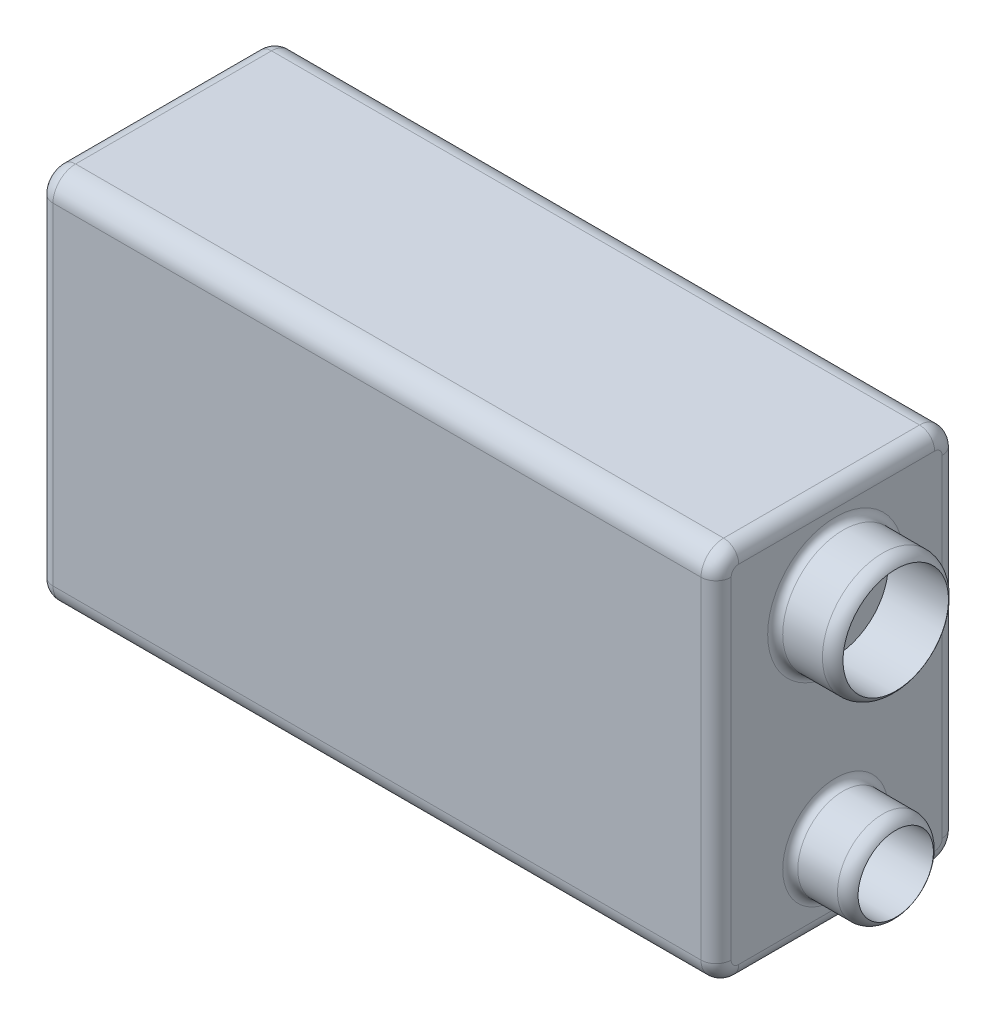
ISO-10303-21;
HEADER;
FILE_DESCRIPTION(('STEP AP214'),'2;1');
FILE_NAME('part.step','',(''),(''),'','','');
FILE_SCHEMA(('AUTOMOTIVE_DESIGN { 1 0 10303 214 1 1 1 1 }'));
ENDSEC;
DATA;
#1=APPLICATION_CONTEXT('core data for automotive mechanical design processes');
#2=APPLICATION_PROTOCOL_DEFINITION('international standard','automotive_design',2000,#1);
#3=PRODUCT_CONTEXT('',#1,'mechanical');
#4=PRODUCT('Part','Part','',(#3));
#5=PRODUCT_RELATED_PRODUCT_CATEGORY('part','',(#4));
#6=PRODUCT_DEFINITION_FORMATION('','',#4);
#7=PRODUCT_DEFINITION_CONTEXT('part definition',#1,'design');
#8=PRODUCT_DEFINITION('design','',#6,#7);
#9=PRODUCT_DEFINITION_SHAPE('','',#8);
#10=(LENGTH_UNIT() NAMED_UNIT(*) SI_UNIT(.MILLI.,.METRE.));
#11=(NAMED_UNIT(*) PLANE_ANGLE_UNIT() SI_UNIT($,.RADIAN.));
#12=(NAMED_UNIT(*) SI_UNIT($,.STERADIAN.) SOLID_ANGLE_UNIT());
#13=UNCERTAINTY_MEASURE_WITH_UNIT(LENGTH_MEASURE(1.E-05),#10,'distance_accuracy_value','');
#14=(GEOMETRIC_REPRESENTATION_CONTEXT(3) GLOBAL_UNCERTAINTY_ASSIGNED_CONTEXT((#13)) GLOBAL_UNIT_ASSIGNED_CONTEXT((#10,
#11,#12)) REPRESENTATION_CONTEXT('',''));
#15=CARTESIAN_POINT('',(0.,0.,0.));
#16=DIRECTION('',(0.,0.,1.));
#17=DIRECTION('',(1.,0.,0.));
#18=AXIS2_PLACEMENT_3D('',#15,#16,#17);
#19=CARTESIAN_POINT('',(45.,0.,16.));
#20=DIRECTION('',(-1.,0.,0.));
#21=DIRECTION('',(0.,0.,1.));
#22=AXIS2_PLACEMENT_3D('',#19,#20,#21);
#23=PLANE('',#22);
#24=CARTESIAN_POINT('',(45.,5.,8.07795165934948));
#25=DIRECTION('',(-1.,0.,0.));
#26=DIRECTION('',(0.,0.,1.));
#27=AXIS2_PLACEMENT_3D('',#24,#25,#26);
#28=CIRCLE('',#27,3.5);
#29=CARTESIAN_POINT('',(45.,5.,11.5779516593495));
#30=VERTEX_POINT('',#29);
#31=EDGE_CURVE('E285',#30,#30,#28,.T.);
#32=ORIENTED_EDGE('',*,*,#31,.T.);
#33=EDGE_LOOP('',(#32));
#34=FACE_BOUND('',#33,.T.);
#35=CARTESIAN_POINT('',(45.,19.,8.07795165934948));
#36=DIRECTION('',(-1.,0.,0.));
#37=DIRECTION('',(0.,0.,1.));
#38=AXIS2_PLACEMENT_3D('',#35,#36,#37);
#39=CIRCLE('',#38,4.5);
#40=CARTESIAN_POINT('',(45.,19.,12.5779516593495));
#41=VERTEX_POINT('',#40);
#42=EDGE_CURVE('E279',#41,#41,#39,.T.);
#43=ORIENTED_EDGE('',*,*,#42,.T.);
#44=EDGE_LOOP('',(#43));
#45=FACE_BOUND('',#44,.T.);
#46=DIRECTION('',(0.,1.,0.));
#47=VECTOR('',#46,1.);
#48=CARTESIAN_POINT('',(45.,0.,15.));
#49=LINE('',#48,#47);
#50=CARTESIAN_POINT('',(45.,23.5,15.));
#51=VERTEX_POINT('',#50);
#52=CARTESIAN_POINT('',(45.,1.5,15.));
#53=VERTEX_POINT('',#52);
#54=EDGE_CURVE('E235',#51,#53,#49,.F.);
#55=ORIENTED_EDGE('',*,*,#54,.T.);
#56=CARTESIAN_POINT('',(45.,1.5,14.5));
#57=DIRECTION('',(-1.,0.,0.));
#58=DIRECTION('',(0.,0.,1.));
#59=AXIS2_PLACEMENT_3D('',#56,#57,#58);
#60=CIRCLE('',#59,0.5);
#61=CARTESIAN_POINT('',(45.,1.,14.5));
#62=VERTEX_POINT('',#61);
#63=EDGE_CURVE('E237',#53,#62,#60,.F.);
#64=ORIENTED_EDGE('',*,*,#63,.T.);
#65=DIRECTION('',(0.,0.,-1.));
#66=VECTOR('',#65,1.);
#67=CARTESIAN_POINT('',(45.,1.,16.));
#68=LINE('',#67,#66);
#69=CARTESIAN_POINT('',(45.,1.,1.5));
#70=VERTEX_POINT('',#69);
#71=EDGE_CURVE('E204',#62,#70,#68,.T.);
#72=ORIENTED_EDGE('',*,*,#71,.T.);
#73=CARTESIAN_POINT('',(45.,1.5,1.5));
#74=DIRECTION('',(-1.,0.,0.));
#75=DIRECTION('',(0.,0.,1.));
#76=AXIS2_PLACEMENT_3D('',#73,#74,#75);
#77=CIRCLE('',#76,0.5);
#78=CARTESIAN_POINT('',(45.,1.5,1.));
#79=VERTEX_POINT('',#78);
#80=EDGE_CURVE('E225',#70,#79,#77,.F.);
#81=ORIENTED_EDGE('',*,*,#80,.T.);
#82=DIRECTION('',(0.,1.,0.));
#83=VECTOR('',#82,1.);
#84=CARTESIAN_POINT('',(45.,23.5,1.));
#85=LINE('',#84,#83);
#86=CARTESIAN_POINT('',(45.,23.5,1.));
#87=VERTEX_POINT('',#86);
#88=EDGE_CURVE('E227',#79,#87,#85,.T.);
#89=ORIENTED_EDGE('',*,*,#88,.T.);
#90=CARTESIAN_POINT('',(45.,23.5,1.5));
#91=DIRECTION('',(-1.,0.,0.));
#92=DIRECTION('',(0.,0.,1.));
#93=AXIS2_PLACEMENT_3D('',#90,#91,#92);
#94=CIRCLE('',#93,0.5);
#95=CARTESIAN_POINT('',(45.,24.,1.5));
#96=VERTEX_POINT('',#95);
#97=EDGE_CURVE('E229',#87,#96,#94,.F.);
#98=ORIENTED_EDGE('',*,*,#97,.T.);
#99=DIRECTION('',(0.,0.,-1.));
#100=VECTOR('',#99,1.);
#101=CARTESIAN_POINT('',(45.,24.,16.));
#102=LINE('',#101,#100);
#103=CARTESIAN_POINT('',(45.,24.,14.5));
#104=VERTEX_POINT('',#103);
#105=EDGE_CURVE('E231',#96,#104,#102,.F.);
#106=ORIENTED_EDGE('',*,*,#105,.T.);
#107=CARTESIAN_POINT('',(45.,23.5,14.5));
#108=DIRECTION('',(-1.,0.,0.));
#109=DIRECTION('',(0.,0.,1.));
#110=AXIS2_PLACEMENT_3D('',#107,#108,#109);
#111=CIRCLE('',#110,0.5);
#112=EDGE_CURVE('E233',#104,#51,#111,.F.);
#113=ORIENTED_EDGE('',*,*,#112,.T.);
#114=EDGE_LOOP('',(#55,#64,#72,#81,#89,#98,#106,#113));
#115=FACE_BOUND('',#114,.T.);
#116=ADVANCED_FACE('F39',(#34,#45,#115),#23,.F.);
#117=CARTESIAN_POINT('',(0.,0.,16.));
#118=DIRECTION('',(1.,0.,0.));
#119=DIRECTION('',(0.,0.,-1.));
#120=AXIS2_PLACEMENT_3D('',#117,#118,#119);
#121=PLANE('',#120);
#122=DIRECTION('',(0.,0.,-1.));
#123=VECTOR('',#122,1.);
#124=CARTESIAN_POINT('',(0.,24.,16.));
#125=LINE('',#124,#123);
#126=CARTESIAN_POINT('',(0.,24.,14.5));
#127=VERTEX_POINT('',#126);
#128=CARTESIAN_POINT('',(0.,24.,1.5));
#129=VERTEX_POINT('',#128);
#130=EDGE_CURVE('E180',#127,#129,#125,.T.);
#131=ORIENTED_EDGE('',*,*,#130,.T.);
#132=CARTESIAN_POINT('',(0.,23.5,1.5));
#133=DIRECTION('',(1.,0.,0.));
#134=DIRECTION('',(0.,0.,-1.));
#135=AXIS2_PLACEMENT_3D('',#132,#133,#134);
#136=CIRCLE('',#135,0.5);
#137=CARTESIAN_POINT('',(0.,23.5,1.));
#138=VERTEX_POINT('',#137);
#139=EDGE_CURVE('E160',#129,#138,#136,.F.);
#140=ORIENTED_EDGE('',*,*,#139,.T.);
#141=DIRECTION('',(0.,-1.,0.));
#142=VECTOR('',#141,1.);
#143=CARTESIAN_POINT('',(0.,1.5,1.));
#144=LINE('',#143,#142);
#145=CARTESIAN_POINT('',(0.,1.5,1.));
#146=VERTEX_POINT('',#145);
#147=EDGE_CURVE('E169',#138,#146,#144,.T.);
#148=ORIENTED_EDGE('',*,*,#147,.T.);
#149=CARTESIAN_POINT('',(0.,1.5,1.5));
#150=DIRECTION('',(1.,0.,0.));
#151=DIRECTION('',(0.,0.,-1.));
#152=AXIS2_PLACEMENT_3D('',#149,#150,#151);
#153=CIRCLE('',#152,0.5);
#154=CARTESIAN_POINT('',(0.,1.,1.5));
#155=VERTEX_POINT('',#154);
#156=EDGE_CURVE('E175',#146,#155,#153,.F.);
#157=ORIENTED_EDGE('',*,*,#156,.T.);
#158=DIRECTION('',(0.,0.,-1.));
#159=VECTOR('',#158,1.);
#160=CARTESIAN_POINT('',(0.,1.,16.));
#161=LINE('',#160,#159);
#162=CARTESIAN_POINT('',(0.,1.,14.5));
#163=VERTEX_POINT('',#162);
#164=EDGE_CURVE('E327',#155,#163,#161,.F.);
#165=ORIENTED_EDGE('',*,*,#164,.T.);
#166=CARTESIAN_POINT('',(0.,1.5,14.5));
#167=DIRECTION('',(1.,0.,0.));
#168=DIRECTION('',(0.,0.,-1.));
#169=AXIS2_PLACEMENT_3D('',#166,#167,#168);
#170=CIRCLE('',#169,0.5);
#171=CARTESIAN_POINT('',(0.,1.5,15.));
#172=VERTEX_POINT('',#171);
#173=EDGE_CURVE('E329',#163,#172,#170,.F.);
#174=ORIENTED_EDGE('',*,*,#173,.T.);
#175=DIRECTION('',(0.,-1.,0.));
#176=VECTOR('',#175,1.);
#177=CARTESIAN_POINT('',(0.,0.,15.));
#178=LINE('',#177,#176);
#179=CARTESIAN_POINT('',(0.,23.5,15.));
#180=VERTEX_POINT('',#179);
#181=EDGE_CURVE('E331',#172,#180,#178,.F.);
#182=ORIENTED_EDGE('',*,*,#181,.T.);
#183=CARTESIAN_POINT('',(0.,23.5,14.5));
#184=DIRECTION('',(1.,0.,0.));
#185=DIRECTION('',(0.,0.,-1.));
#186=AXIS2_PLACEMENT_3D('',#183,#184,#185);
#187=CIRCLE('',#186,0.5);
#188=EDGE_CURVE('E185',#180,#127,#187,.F.);
#189=ORIENTED_EDGE('',*,*,#188,.T.);
#190=EDGE_LOOP('',(#131,#140,#148,#157,#165,#174,#182,#189));
#191=FACE_BOUND('',#190,.T.);
#192=ADVANCED_FACE('F178',(#191),#121,.F.);
#193=CARTESIAN_POINT('',(0.,0.,16.));
#194=DIRECTION('',(0.,1.,0.));
#195=DIRECTION('',(0.,0.,1.));
#196=AXIS2_PLACEMENT_3D('',#193,#194,#195);
#197=PLANE('',#196);
#198=DIRECTION('',(1.,0.,0.));
#199=VECTOR('',#198,1.);
#200=CARTESIAN_POINT('',(45.,0.,1.5));
#201=LINE('',#200,#199);
#202=CARTESIAN_POINT('',(1.,0.,1.5));
#203=VERTEX_POINT('',#202);
#204=CARTESIAN_POINT('',(44.,0.,1.5));
#205=VERTEX_POINT('',#204);
#206=EDGE_CURVE('E323',#203,#205,#201,.T.);
#207=ORIENTED_EDGE('',*,*,#206,.T.);
#208=DIRECTION('',(0.,0.,-1.));
#209=VECTOR('',#208,1.);
#210=CARTESIAN_POINT('',(44.,0.,16.));
#211=LINE('',#210,#209);
#212=CARTESIAN_POINT('',(44.,0.,14.5));
#213=VERTEX_POINT('',#212);
#214=EDGE_CURVE('E253',#205,#213,#211,.F.);
#215=ORIENTED_EDGE('',*,*,#214,.T.);
#216=DIRECTION('',(1.,0.,0.));
#217=VECTOR('',#216,1.);
#218=CARTESIAN_POINT('',(0.,0.,14.5));
#219=LINE('',#218,#217);
#220=CARTESIAN_POINT('',(1.,0.,14.5));
#221=VERTEX_POINT('',#220);
#222=EDGE_CURVE('E317',#213,#221,#219,.F.);
#223=ORIENTED_EDGE('',*,*,#222,.T.);
#224=DIRECTION('',(0.,0.,-1.));
#225=VECTOR('',#224,1.);
#226=CARTESIAN_POINT('',(1.,0.,16.));
#227=LINE('',#226,#225);
#228=EDGE_CURVE('E198',#221,#203,#227,.T.);
#229=ORIENTED_EDGE('',*,*,#228,.T.);
#230=EDGE_LOOP('',(#207,#215,#223,#229));
#231=FACE_BOUND('',#230,.T.);
#232=ADVANCED_FACE('F370',(#231),#197,.F.);
#233=CARTESIAN_POINT('',(0.,25.,16.));
#234=DIRECTION('',(0.,-1.,0.));
#235=DIRECTION('',(0.,0.,-1.));
#236=AXIS2_PLACEMENT_3D('',#233,#234,#235);
#237=PLANE('',#236);
#238=DIRECTION('',(-1.,0.,0.));
#239=VECTOR('',#238,1.);
#240=CARTESIAN_POINT('',(0.,25.,14.5));
#241=LINE('',#240,#239);
#242=CARTESIAN_POINT('',(1.,25.,14.5));
#243=VERTEX_POINT('',#242);
#244=CARTESIAN_POINT('',(44.,25.,14.5));
#245=VERTEX_POINT('',#244);
#246=EDGE_CURVE('E304',#243,#245,#241,.F.);
#247=ORIENTED_EDGE('',*,*,#246,.T.);
#248=DIRECTION('',(0.,0.,-1.));
#249=VECTOR('',#248,1.);
#250=CARTESIAN_POINT('',(44.,25.,16.));
#251=LINE('',#250,#249);
#252=CARTESIAN_POINT('',(44.,25.,1.5));
#253=VERTEX_POINT('',#252);
#254=EDGE_CURVE('E247',#245,#253,#251,.T.);
#255=ORIENTED_EDGE('',*,*,#254,.T.);
#256=DIRECTION('',(-1.,0.,0.));
#257=VECTOR('',#256,1.);
#258=CARTESIAN_POINT('',(0.,25.,1.5));
#259=LINE('',#258,#257);
#260=CARTESIAN_POINT('',(1.,25.,1.5));
#261=VERTEX_POINT('',#260);
#262=EDGE_CURVE('E319',#253,#261,#259,.T.);
#263=ORIENTED_EDGE('',*,*,#262,.T.);
#264=DIRECTION('',(0.,0.,-1.));
#265=VECTOR('',#264,1.);
#266=CARTESIAN_POINT('',(1.,25.,16.));
#267=LINE('',#266,#265);
#268=EDGE_CURVE('E183',#261,#243,#267,.F.);
#269=ORIENTED_EDGE('',*,*,#268,.T.);
#270=EDGE_LOOP('',(#247,#255,#263,#269));
#271=FACE_BOUND('',#270,.T.);
#272=ADVANCED_FACE('F401',(#271),#237,.F.);
#273=CARTESIAN_POINT('',(0.,25.,16.));
#274=DIRECTION('',(0.,0.,-1.));
#275=DIRECTION('',(-1.,0.,0.));
#276=AXIS2_PLACEMENT_3D('',#273,#274,#275);
#277=PLANE('',#276);
#278=DIRECTION('',(1.,0.,0.));
#279=VECTOR('',#278,1.);
#280=CARTESIAN_POINT('',(0.,1.5,16.));
#281=LINE('',#280,#279);
#282=CARTESIAN_POINT('',(1.,1.5,16.));
#283=VERTEX_POINT('',#282);
#284=CARTESIAN_POINT('',(44.,1.5,16.));
#285=VERTEX_POINT('',#284);
#286=EDGE_CURVE('E314',#283,#285,#281,.T.);
#287=ORIENTED_EDGE('',*,*,#286,.T.);
#288=DIRECTION('',(0.,1.,0.));
#289=VECTOR('',#288,1.);
#290=CARTESIAN_POINT('',(44.,25.,16.));
#291=LINE('',#290,#289);
#292=CARTESIAN_POINT('',(44.,23.5,16.));
#293=VERTEX_POINT('',#292);
#294=EDGE_CURVE('E243',#285,#293,#291,.T.);
#295=ORIENTED_EDGE('',*,*,#294,.T.);
#296=DIRECTION('',(-1.,0.,0.));
#297=VECTOR('',#296,1.);
#298=CARTESIAN_POINT('',(0.,23.5,16.));
#299=LINE('',#298,#297);
#300=CARTESIAN_POINT('',(1.,23.5,16.));
#301=VERTEX_POINT('',#300);
#302=EDGE_CURVE('E301',#293,#301,#299,.T.);
#303=ORIENTED_EDGE('',*,*,#302,.T.);
#304=DIRECTION('',(0.,-1.,0.));
#305=VECTOR('',#304,1.);
#306=CARTESIAN_POINT('',(1.,25.,16.));
#307=LINE('',#306,#305);
#308=EDGE_CURVE('E193',#301,#283,#307,.T.);
#309=ORIENTED_EDGE('',*,*,#308,.T.);
#310=EDGE_LOOP('',(#287,#295,#303,#309));
#311=FACE_BOUND('',#310,.T.);
#312=ADVANCED_FACE('F388',(#311),#277,.F.);
#313=CARTESIAN_POINT('',(0.,25.,0.));
#314=DIRECTION('',(0.,0.,-1.));
#315=DIRECTION('',(-1.,0.,0.));
#316=AXIS2_PLACEMENT_3D('',#313,#314,#315);
#317=PLANE('',#316);
#318=DIRECTION('',(-1.,0.,0.));
#319=VECTOR('',#318,1.);
#320=CARTESIAN_POINT('',(45.,23.5,0.));
#321=LINE('',#320,#319);
#322=CARTESIAN_POINT('',(1.,23.5,0.));
#323=VERTEX_POINT('',#322);
#324=CARTESIAN_POINT('',(44.,23.5,0.));
#325=VERTEX_POINT('',#324);
#326=EDGE_CURVE('E321',#323,#325,#321,.F.);
#327=ORIENTED_EDGE('',*,*,#326,.T.);
#328=DIRECTION('',(0.,1.,0.));
#329=VECTOR('',#328,1.);
#330=CARTESIAN_POINT('',(44.,1.5,0.));
#331=LINE('',#330,#329);
#332=CARTESIAN_POINT('',(44.,1.5,0.));
#333=VERTEX_POINT('',#332);
#334=EDGE_CURVE('E62',#325,#333,#331,.F.);
#335=ORIENTED_EDGE('',*,*,#334,.T.);
#336=DIRECTION('',(1.,0.,0.));
#337=VECTOR('',#336,1.);
#338=CARTESIAN_POINT('',(0.,1.5,0.));
#339=LINE('',#338,#337);
#340=CARTESIAN_POINT('',(1.,1.5,0.));
#341=VERTEX_POINT('',#340);
#342=EDGE_CURVE('E176',#333,#341,#339,.F.);
#343=ORIENTED_EDGE('',*,*,#342,.T.);
#344=DIRECTION('',(0.,-1.,0.));
#345=VECTOR('',#344,1.);
#346=CARTESIAN_POINT('',(1.,23.5,0.));
#347=LINE('',#346,#345);
#348=EDGE_CURVE('E203',#341,#323,#347,.F.);
#349=ORIENTED_EDGE('',*,*,#348,.T.);
#350=EDGE_LOOP('',(#327,#335,#343,#349));
#351=FACE_BOUND('',#350,.T.);
#352=ADVANCED_FACE('F350',(#351),#317,.T.);
#353=CARTESIAN_POINT('',(49.,19.,8.07795165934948));
#354=DIRECTION('',(-1.,0.,0.));
#355=DIRECTION('',(0.,0.,1.));
#356=AXIS2_PLACEMENT_3D('',#353,#354,#355);
#357=CYLINDRICAL_SURFACE('',#356,4.);
#358=CARTESIAN_POINT('',(48.1339745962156,19.,8.07795165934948));
#359=DIRECTION('',(1.,0.,0.));
#360=DIRECTION('',(0.,0.,-1.));
#361=AXIS2_PLACEMENT_3D('',#358,#359,#360);
#362=CIRCLE('',#361,4.);
#363=CARTESIAN_POINT('',(48.1339745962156,19.,4.07795165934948));
#364=VERTEX_POINT('',#363);
#365=EDGE_CURVE('E47',#364,#364,#362,.F.);
#366=ORIENTED_EDGE('',*,*,#365,.T.);
#367=EDGE_LOOP('',(#366));
#368=FACE_BOUND('',#367,.T.);
#369=CARTESIAN_POINT('',(45.5,19.,8.07795165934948));
#370=DIRECTION('',(-1.,0.,0.));
#371=DIRECTION('',(0.,0.,1.));
#372=AXIS2_PLACEMENT_3D('',#369,#370,#371);
#373=CIRCLE('',#372,4.);
#374=CARTESIAN_POINT('',(45.5,19.,12.0779516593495));
#375=VERTEX_POINT('',#374);
#376=EDGE_CURVE('E255',#375,#375,#373,.F.);
#377=ORIENTED_EDGE('',*,*,#376,.T.);
#378=EDGE_LOOP('',(#377));
#379=FACE_BOUND('',#378,.T.);
#380=ADVANCED_FACE('F290',(#368,#379),#357,.T.);
#381=CARTESIAN_POINT('',(49.,5.,8.07795165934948));
#382=DIRECTION('',(-1.,0.,0.));
#383=DIRECTION('',(0.,0.,1.));
#384=AXIS2_PLACEMENT_3D('',#381,#382,#383);
#385=CYLINDRICAL_SURFACE('',#384,3.);
#386=CARTESIAN_POINT('',(48.1339745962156,5.,8.07795165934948));
#387=DIRECTION('',(1.,0.,0.));
#388=DIRECTION('',(0.,0.,-1.));
#389=AXIS2_PLACEMENT_3D('',#386,#387,#388);
#390=CIRCLE('',#389,3.);
#391=CARTESIAN_POINT('',(48.1339745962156,5.,5.07795165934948));
#392=VERTEX_POINT('',#391);
#393=EDGE_CURVE('E11',#392,#392,#390,.F.);
#394=ORIENTED_EDGE('',*,*,#393,.T.);
#395=EDGE_LOOP('',(#394));
#396=FACE_BOUND('',#395,.T.);
#397=CARTESIAN_POINT('',(45.5,5.,8.07795165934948));
#398=DIRECTION('',(-1.,0.,0.));
#399=DIRECTION('',(0.,0.,1.));
#400=AXIS2_PLACEMENT_3D('',#397,#398,#399);
#401=CIRCLE('',#400,3.);
#402=CARTESIAN_POINT('',(45.5,5.,11.0779516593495));
#403=VERTEX_POINT('',#402);
#404=EDGE_CURVE('E282',#403,#403,#401,.F.);
#405=ORIENTED_EDGE('',*,*,#404,.T.);
#406=EDGE_LOOP('',(#405));
#407=FACE_BOUND('',#406,.T.);
#408=ADVANCED_FACE('F483',(#396,#407),#385,.T.);
#409=CARTESIAN_POINT('',(49.,19.,8.07795165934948));
#410=DIRECTION('',(-1.,0.,0.));
#411=DIRECTION('',(0.,0.,1.));
#412=AXIS2_PLACEMENT_3D('',#409,#410,#411);
#413=CYLINDRICAL_SURFACE('',#412,3.5);
#414=CARTESIAN_POINT('',(49.,19.,8.07795165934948));
#415=DIRECTION('',(1.,0.,0.));
#416=DIRECTION('',(0.,0.,-1.));
#417=AXIS2_PLACEMENT_3D('',#414,#415,#416);
#418=CIRCLE('',#417,3.5);
#419=CARTESIAN_POINT('',(49.,19.,4.57795165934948));
#420=VERTEX_POINT('',#419);
#421=EDGE_CURVE('E299',#420,#420,#418,.T.);
#422=ORIENTED_EDGE('',*,*,#421,.T.);
#423=EDGE_LOOP('',(#422));
#424=FACE_BOUND('',#423,.T.);
#425=CARTESIAN_POINT('',(45.,19.,8.07795165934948));
#426=DIRECTION('',(1.,0.,0.));
#427=DIRECTION('',(0.,0.,-1.));
#428=AXIS2_PLACEMENT_3D('',#425,#426,#427);
#429=CIRCLE('',#428,3.5);
#430=CARTESIAN_POINT('',(45.,19.,4.57795165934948));
#431=VERTEX_POINT('',#430);
#432=EDGE_CURVE('E302',#431,#431,#429,.T.);
#433=ORIENTED_EDGE('',*,*,#432,.F.);
#434=EDGE_LOOP('',(#433));
#435=FACE_BOUND('',#434,.T.);
#436=ADVANCED_FACE('F485',(#424,#435),#413,.F.);
#437=CARTESIAN_POINT('',(45.,19.,8.07795165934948));
#438=DIRECTION('',(1.,0.,0.));
#439=DIRECTION('',(0.,0.,-1.));
#440=AXIS2_PLACEMENT_3D('',#437,#438,#439);
#441=PLANE('',#440);
#442=ORIENTED_EDGE('',*,*,#432,.T.);
#443=EDGE_LOOP('',(#442));
#444=FACE_BOUND('',#443,.T.);
#445=ADVANCED_FACE('F492',(#444),#441,.T.);
#446=CARTESIAN_POINT('',(45.,5.,8.07795165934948));
#447=DIRECTION('',(1.,0.,0.));
#448=DIRECTION('',(0.,0.,-1.));
#449=AXIS2_PLACEMENT_3D('',#446,#447,#448);
#450=CYLINDRICAL_SURFACE('',#449,2.5);
#451=CARTESIAN_POINT('',(45.,5.,8.07795165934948));
#452=DIRECTION('',(1.,0.,0.));
#453=DIRECTION('',(0.,0.,-1.));
#454=AXIS2_PLACEMENT_3D('',#451,#452,#453);
#455=CIRCLE('',#454,2.5);
#456=CARTESIAN_POINT('',(45.,5.,5.57795165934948));
#457=VERTEX_POINT('',#456);
#458=EDGE_CURVE('E307',#457,#457,#455,.T.);
#459=ORIENTED_EDGE('',*,*,#458,.F.);
#460=EDGE_LOOP('',(#459));
#461=FACE_BOUND('',#460,.T.);
#462=CARTESIAN_POINT('',(49.,5.,8.07795165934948));
#463=DIRECTION('',(1.,0.,0.));
#464=DIRECTION('',(0.,0.,-1.));
#465=AXIS2_PLACEMENT_3D('',#462,#463,#464);
#466=CIRCLE('',#465,2.5);
#467=CARTESIAN_POINT('',(49.,5.,5.57795165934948));
#468=VERTEX_POINT('',#467);
#469=EDGE_CURVE('E223',#468,#468,#466,.T.);
#470=ORIENTED_EDGE('',*,*,#469,.T.);
#471=EDGE_LOOP('',(#470));
#472=FACE_BOUND('',#471,.T.);
#473=ADVANCED_FACE('F582',(#461,#472),#450,.F.);
#474=CARTESIAN_POINT('',(45.,5.,8.07795165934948));
#475=DIRECTION('',(1.,0.,0.));
#476=DIRECTION('',(0.,0.,-1.));
#477=AXIS2_PLACEMENT_3D('',#474,#475,#476);
#478=PLANE('',#477);
#479=ORIENTED_EDGE('',*,*,#458,.T.);
#480=EDGE_LOOP('',(#479));
#481=FACE_BOUND('',#480,.T.);
#482=ADVANCED_FACE('F424',(#481),#478,.T.);
#483=CARTESIAN_POINT('',(0.,23.5,14.5));
#484=DIRECTION('',(-1.,0.,0.));
#485=DIRECTION('',(0.,0.,1.));
#486=AXIS2_PLACEMENT_3D('',#483,#484,#485);
#487=CYLINDRICAL_SURFACE('',#486,1.5);
#488=ORIENTED_EDGE('',*,*,#302,.F.);
#489=CARTESIAN_POINT('',(44.,23.5,14.5));
#490=DIRECTION('',(-1.,0.,0.));
#491=DIRECTION('',(0.,0.,1.));
#492=AXIS2_PLACEMENT_3D('',#489,#490,#491);
#493=CIRCLE('',#492,1.5);
#494=EDGE_CURVE('E245',#293,#245,#493,.T.);
#495=ORIENTED_EDGE('',*,*,#494,.T.);
#496=ORIENTED_EDGE('',*,*,#246,.F.);
#497=CARTESIAN_POINT('',(1.,23.5,14.5));
#498=DIRECTION('',(1.,0.,0.));
#499=DIRECTION('',(0.,0.,-1.));
#500=AXIS2_PLACEMENT_3D('',#497,#498,#499);
#501=CIRCLE('',#500,1.5);
#502=EDGE_CURVE('E190',#243,#301,#501,.T.);
#503=ORIENTED_EDGE('',*,*,#502,.T.);
#504=EDGE_LOOP('',(#488,#495,#496,#503));
#505=FACE_BOUND('',#504,.T.);
#506=ADVANCED_FACE('F391',(#505),#487,.T.);
#507=CARTESIAN_POINT('',(0.,1.5,14.5));
#508=DIRECTION('',(1.,0.,0.));
#509=DIRECTION('',(0.,0.,-1.));
#510=AXIS2_PLACEMENT_3D('',#507,#508,#509);
#511=CYLINDRICAL_SURFACE('',#510,1.5);
#512=ORIENTED_EDGE('',*,*,#222,.F.);
#513=CARTESIAN_POINT('',(44.,1.5,14.5));
#514=DIRECTION('',(-1.,0.,0.));
#515=DIRECTION('',(0.,0.,1.));
#516=AXIS2_PLACEMENT_3D('',#513,#514,#515);
#517=CIRCLE('',#516,1.5);
#518=EDGE_CURVE('E240',#213,#285,#517,.T.);
#519=ORIENTED_EDGE('',*,*,#518,.T.);
#520=ORIENTED_EDGE('',*,*,#286,.F.);
#521=CARTESIAN_POINT('',(1.,1.5,14.5));
#522=DIRECTION('',(1.,0.,0.));
#523=DIRECTION('',(0.,0.,-1.));
#524=AXIS2_PLACEMENT_3D('',#521,#522,#523);
#525=CIRCLE('',#524,1.5);
#526=EDGE_CURVE('E195',#283,#221,#525,.T.);
#527=ORIENTED_EDGE('',*,*,#526,.T.);
#528=EDGE_LOOP('',(#512,#519,#520,#527));
#529=FACE_BOUND('',#528,.T.);
#530=ADVANCED_FACE('F373',(#529),#511,.T.);
#531=CARTESIAN_POINT('',(0.,23.5,1.5));
#532=DIRECTION('',(1.,0.,0.));
#533=DIRECTION('',(0.,0.,-1.));
#534=AXIS2_PLACEMENT_3D('',#531,#532,#533);
#535=CYLINDRICAL_SURFACE('',#534,1.5);
#536=ORIENTED_EDGE('',*,*,#262,.F.);
#537=CARTESIAN_POINT('',(44.,23.5,1.5));
#538=DIRECTION('',(-1.,0.,0.));
#539=DIRECTION('',(0.,0.,1.));
#540=AXIS2_PLACEMENT_3D('',#537,#538,#539);
#541=CIRCLE('',#540,1.5);
#542=EDGE_CURVE('E249',#253,#325,#541,.T.);
#543=ORIENTED_EDGE('',*,*,#542,.T.);
#544=ORIENTED_EDGE('',*,*,#326,.F.);
#545=CARTESIAN_POINT('',(1.,23.5,1.5));
#546=DIRECTION('',(1.,0.,0.));
#547=DIRECTION('',(0.,0.,-1.));
#548=AXIS2_PLACEMENT_3D('',#545,#546,#547);
#549=CIRCLE('',#548,1.5);
#550=EDGE_CURVE('E162',#323,#261,#549,.T.);
#551=ORIENTED_EDGE('',*,*,#550,.T.);
#552=EDGE_LOOP('',(#536,#543,#544,#551));
#553=FACE_BOUND('',#552,.T.);
#554=ADVANCED_FACE('F347',(#553),#535,.T.);
#555=CARTESIAN_POINT('',(0.,1.5,1.5));
#556=DIRECTION('',(-1.,0.,0.));
#557=DIRECTION('',(0.,0.,1.));
#558=AXIS2_PLACEMENT_3D('',#555,#556,#557);
#559=CYLINDRICAL_SURFACE('',#558,1.5);
#560=ORIENTED_EDGE('',*,*,#342,.F.);
#561=CARTESIAN_POINT('',(44.,1.5,1.5));
#562=DIRECTION('',(-1.,0.,0.));
#563=DIRECTION('',(0.,0.,1.));
#564=AXIS2_PLACEMENT_3D('',#561,#562,#563);
#565=CIRCLE('',#564,1.5);
#566=EDGE_CURVE('E54',#333,#205,#565,.T.);
#567=ORIENTED_EDGE('',*,*,#566,.T.);
#568=ORIENTED_EDGE('',*,*,#206,.F.);
#569=CARTESIAN_POINT('',(1.,1.5,1.5));
#570=DIRECTION('',(1.,0.,0.));
#571=DIRECTION('',(0.,0.,-1.));
#572=AXIS2_PLACEMENT_3D('',#569,#570,#571);
#573=CIRCLE('',#572,1.5);
#574=EDGE_CURVE('E200',#203,#341,#573,.T.);
#575=ORIENTED_EDGE('',*,*,#574,.T.);
#576=EDGE_LOOP('',(#560,#567,#568,#575));
#577=FACE_BOUND('',#576,.T.);
#578=ADVANCED_FACE('F429',(#577),#559,.T.);
#579=CARTESIAN_POINT('',(1.,1.5,14.5));
#580=DIRECTION('',(1.,0.,0.));
#581=DIRECTION('',(0.,0.,-1.));
#582=AXIS2_PLACEMENT_3D('',#579,#580,#581);
#583=DEGENERATE_TOROIDAL_SURFACE('',#582,0.5,1.,.T.);
#584=CARTESIAN_POINT('',(1.,1.,14.5));
#585=DIRECTION('',(0.,0.,-1.));
#586=DIRECTION('',(-1.,0.,0.));
#587=AXIS2_PLACEMENT_3D('',#584,#585,#586);
#588=CIRCLE('',#587,1.);
#589=EDGE_CURVE('E217',#221,#163,#588,.T.);
#590=ORIENTED_EDGE('',*,*,#589,.F.);
#591=ORIENTED_EDGE('',*,*,#526,.F.);
#592=CARTESIAN_POINT('',(1.,1.5,15.));
#593=DIRECTION('',(0.,1.,0.));
#594=DIRECTION('',(0.,0.,1.));
#595=AXIS2_PLACEMENT_3D('',#592,#593,#594);
#596=CIRCLE('',#595,1.);
#597=EDGE_CURVE('E220',#172,#283,#596,.T.);
#598=ORIENTED_EDGE('',*,*,#597,.F.);
#599=ORIENTED_EDGE('',*,*,#173,.F.);
#600=EDGE_LOOP('',(#590,#591,#598,#599));
#601=FACE_BOUND('',#600,.T.);
#602=ADVANCED_FACE('F432',(#601),#583,.T.);
#603=CARTESIAN_POINT('',(1.,25.,15.));
#604=DIRECTION('',(0.,-1.,0.));
#605=DIRECTION('',(0.,0.,-1.));
#606=AXIS2_PLACEMENT_3D('',#603,#604,#605);
#607=CYLINDRICAL_SURFACE('',#606,1.);
#608=ORIENTED_EDGE('',*,*,#597,.T.);
#609=ORIENTED_EDGE('',*,*,#308,.F.);
#610=CARTESIAN_POINT('',(1.,23.5,15.));
#611=DIRECTION('',(0.,1.,0.));
#612=DIRECTION('',(0.,0.,1.));
#613=AXIS2_PLACEMENT_3D('',#610,#611,#612);
#614=CIRCLE('',#613,1.);
#615=EDGE_CURVE('E214',#180,#301,#614,.T.);
#616=ORIENTED_EDGE('',*,*,#615,.F.);
#617=ORIENTED_EDGE('',*,*,#181,.F.);
#618=EDGE_LOOP('',(#608,#609,#616,#617));
#619=FACE_BOUND('',#618,.T.);
#620=ADVANCED_FACE('F448',(#619),#607,.T.);
#621=CARTESIAN_POINT('',(1.,1.,16.));
#622=DIRECTION('',(0.,0.,-1.));
#623=DIRECTION('',(-1.,0.,0.));
#624=AXIS2_PLACEMENT_3D('',#621,#622,#623);
#625=CYLINDRICAL_SURFACE('',#624,1.);
#626=ORIENTED_EDGE('',*,*,#589,.T.);
#627=ORIENTED_EDGE('',*,*,#164,.F.);
#628=CARTESIAN_POINT('',(1.,1.,1.5));
#629=DIRECTION('',(0.,0.,-1.));
#630=DIRECTION('',(-1.,0.,0.));
#631=AXIS2_PLACEMENT_3D('',#628,#629,#630);
#632=CIRCLE('',#631,1.);
#633=EDGE_CURVE('E211',#203,#155,#632,.T.);
#634=ORIENTED_EDGE('',*,*,#633,.F.);
#635=ORIENTED_EDGE('',*,*,#228,.F.);
#636=EDGE_LOOP('',(#626,#627,#634,#635));
#637=FACE_BOUND('',#636,.T.);
#638=ADVANCED_FACE('F445',(#637),#625,.T.);
#639=CARTESIAN_POINT('',(1.,23.5,14.5));
#640=DIRECTION('',(1.,0.,0.));
#641=DIRECTION('',(0.,0.,-1.));
#642=AXIS2_PLACEMENT_3D('',#639,#640,#641);
#643=DEGENERATE_TOROIDAL_SURFACE('',#642,0.5,1.,.T.);
#644=ORIENTED_EDGE('',*,*,#615,.T.);
#645=ORIENTED_EDGE('',*,*,#502,.F.);
#646=CARTESIAN_POINT('',(1.,24.,14.5));
#647=DIRECTION('',(0.,0.,-1.));
#648=DIRECTION('',(-1.,0.,0.));
#649=AXIS2_PLACEMENT_3D('',#646,#647,#648);
#650=CIRCLE('',#649,1.);
#651=EDGE_CURVE('E208',#127,#243,#650,.T.);
#652=ORIENTED_EDGE('',*,*,#651,.F.);
#653=ORIENTED_EDGE('',*,*,#188,.F.);
#654=EDGE_LOOP('',(#644,#645,#652,#653));
#655=FACE_BOUND('',#654,.T.);
#656=ADVANCED_FACE('F338',(#655),#643,.T.);
#657=CARTESIAN_POINT('',(1.,1.5,1.5));
#658=DIRECTION('',(1.,0.,0.));
#659=DIRECTION('',(0.,0.,-1.));
#660=AXIS2_PLACEMENT_3D('',#657,#658,#659);
#661=DEGENERATE_TOROIDAL_SURFACE('',#660,0.5,1.,.T.);
#662=ORIENTED_EDGE('',*,*,#633,.T.);
#663=ORIENTED_EDGE('',*,*,#156,.F.);
#664=CARTESIAN_POINT('',(1.,1.5,1.));
#665=DIRECTION('',(0.,1.,0.));
#666=DIRECTION('',(0.,0.,1.));
#667=AXIS2_PLACEMENT_3D('',#664,#665,#666);
#668=CIRCLE('',#667,1.);
#669=EDGE_CURVE('E172',#341,#146,#668,.T.);
#670=ORIENTED_EDGE('',*,*,#669,.F.);
#671=ORIENTED_EDGE('',*,*,#574,.F.);
#672=EDGE_LOOP('',(#662,#663,#670,#671));
#673=FACE_BOUND('',#672,.T.);
#674=ADVANCED_FACE('F439',(#673),#661,.T.);
#675=CARTESIAN_POINT('',(1.,24.,16.));
#676=DIRECTION('',(0.,0.,-1.));
#677=DIRECTION('',(-1.,0.,0.));
#678=AXIS2_PLACEMENT_3D('',#675,#676,#677);
#679=CYLINDRICAL_SURFACE('',#678,1.);
#680=ORIENTED_EDGE('',*,*,#651,.T.);
#681=ORIENTED_EDGE('',*,*,#268,.F.);
#682=CARTESIAN_POINT('',(1.,24.,1.5));
#683=DIRECTION('',(0.,0.,-1.));
#684=DIRECTION('',(-1.,0.,0.));
#685=AXIS2_PLACEMENT_3D('',#682,#683,#684);
#686=CIRCLE('',#685,1.);
#687=EDGE_CURVE('E165',#129,#261,#686,.T.);
#688=ORIENTED_EDGE('',*,*,#687,.F.);
#689=ORIENTED_EDGE('',*,*,#130,.F.);
#690=EDGE_LOOP('',(#680,#681,#688,#689));
#691=FACE_BOUND('',#690,.T.);
#692=ADVANCED_FACE('F341',(#691),#679,.T.);
#693=CARTESIAN_POINT('',(1.,0.,1.));
#694=DIRECTION('',(0.,1.,0.));
#695=DIRECTION('',(0.,0.,1.));
#696=AXIS2_PLACEMENT_3D('',#693,#694,#695);
#697=CYLINDRICAL_SURFACE('',#696,1.);
#698=ORIENTED_EDGE('',*,*,#669,.T.);
#699=ORIENTED_EDGE('',*,*,#147,.F.);
#700=CARTESIAN_POINT('',(1.,23.5,1.));
#701=DIRECTION('',(0.,1.,0.));
#702=DIRECTION('',(0.,0.,1.));
#703=AXIS2_PLACEMENT_3D('',#700,#701,#702);
#704=CIRCLE('',#703,1.);
#705=EDGE_CURVE('E155',#323,#138,#704,.T.);
#706=ORIENTED_EDGE('',*,*,#705,.F.);
#707=ORIENTED_EDGE('',*,*,#348,.F.);
#708=EDGE_LOOP('',(#698,#699,#706,#707));
#709=FACE_BOUND('',#708,.T.);
#710=ADVANCED_FACE('F170',(#709),#697,.T.);
#711=CARTESIAN_POINT('',(1.,23.5,1.5));
#712=DIRECTION('',(1.,0.,0.));
#713=DIRECTION('',(0.,0.,-1.));
#714=AXIS2_PLACEMENT_3D('',#711,#712,#713);
#715=DEGENERATE_TOROIDAL_SURFACE('',#714,0.5,1.,.T.);
#716=ORIENTED_EDGE('',*,*,#687,.T.);
#717=ORIENTED_EDGE('',*,*,#550,.F.);
#718=ORIENTED_EDGE('',*,*,#705,.T.);
#719=ORIENTED_EDGE('',*,*,#139,.F.);
#720=EDGE_LOOP('',(#716,#717,#718,#719));
#721=FACE_BOUND('',#720,.T.);
#722=ADVANCED_FACE('F158',(#721),#715,.T.);
#723=CARTESIAN_POINT('',(44.,23.5,1.5));
#724=DIRECTION('',(-1.,0.,0.));
#725=DIRECTION('',(0.,0.,1.));
#726=AXIS2_PLACEMENT_3D('',#723,#724,#725);
#727=DEGENERATE_TOROIDAL_SURFACE('',#726,0.5,1.,.T.);
#728=CARTESIAN_POINT('',(44.,23.5,1.));
#729=DIRECTION('',(0.,-1.,0.));
#730=DIRECTION('',(0.,0.,-1.));
#731=AXIS2_PLACEMENT_3D('',#728,#729,#730);
#732=CIRCLE('',#731,1.);
#733=EDGE_CURVE('E272',#325,#87,#732,.T.);
#734=ORIENTED_EDGE('',*,*,#733,.F.);
#735=ORIENTED_EDGE('',*,*,#542,.F.);
#736=CARTESIAN_POINT('',(44.,24.,1.5));
#737=DIRECTION('',(0.,0.,1.));
#738=DIRECTION('',(1.,0.,0.));
#739=AXIS2_PLACEMENT_3D('',#736,#737,#738);
#740=CIRCLE('',#739,1.);
#741=EDGE_CURVE('E166',#96,#253,#740,.T.);
#742=ORIENTED_EDGE('',*,*,#741,.F.);
#743=ORIENTED_EDGE('',*,*,#97,.F.);
#744=EDGE_LOOP('',(#734,#735,#742,#743));
#745=FACE_BOUND('',#744,.T.);
#746=ADVANCED_FACE('F353',(#745),#727,.T.);
#747=CARTESIAN_POINT('',(44.,24.,16.));
#748=DIRECTION('',(0.,0.,-1.));
#749=DIRECTION('',(-1.,0.,0.));
#750=AXIS2_PLACEMENT_3D('',#747,#748,#749);
#751=CYLINDRICAL_SURFACE('',#750,1.);
#752=ORIENTED_EDGE('',*,*,#741,.T.);
#753=ORIENTED_EDGE('',*,*,#254,.F.);
#754=CARTESIAN_POINT('',(44.,24.,14.5));
#755=DIRECTION('',(0.,0.,1.));
#756=DIRECTION('',(1.,0.,0.));
#757=AXIS2_PLACEMENT_3D('',#754,#755,#756);
#758=CIRCLE('',#757,1.);
#759=EDGE_CURVE('E269',#104,#245,#758,.T.);
#760=ORIENTED_EDGE('',*,*,#759,.F.);
#761=ORIENTED_EDGE('',*,*,#105,.F.);
#762=EDGE_LOOP('',(#752,#753,#760,#761));
#763=FACE_BOUND('',#762,.T.);
#764=ADVANCED_FACE('F400',(#763),#751,.T.);
#765=CARTESIAN_POINT('',(44.,0.,1.));
#766=DIRECTION('',(0.,-1.,0.));
#767=DIRECTION('',(0.,0.,-1.));
#768=AXIS2_PLACEMENT_3D('',#765,#766,#767);
#769=CYLINDRICAL_SURFACE('',#768,1.);
#770=ORIENTED_EDGE('',*,*,#733,.T.);
#771=ORIENTED_EDGE('',*,*,#88,.F.);
#772=CARTESIAN_POINT('',(44.,1.5,1.));
#773=DIRECTION('',(0.,-1.,0.));
#774=DIRECTION('',(0.,0.,-1.));
#775=AXIS2_PLACEMENT_3D('',#772,#773,#774);
#776=CIRCLE('',#775,1.);
#777=EDGE_CURVE('E266',#333,#79,#776,.T.);
#778=ORIENTED_EDGE('',*,*,#777,.F.);
#779=ORIENTED_EDGE('',*,*,#334,.F.);
#780=EDGE_LOOP('',(#770,#771,#778,#779));
#781=FACE_BOUND('',#780,.T.);
#782=ADVANCED_FACE('F358',(#781),#769,.T.);
#783=CARTESIAN_POINT('',(44.,23.5,14.5));
#784=DIRECTION('',(-1.,0.,0.));
#785=DIRECTION('',(0.,0.,1.));
#786=AXIS2_PLACEMENT_3D('',#783,#784,#785);
#787=DEGENERATE_TOROIDAL_SURFACE('',#786,0.5,1.,.T.);
#788=ORIENTED_EDGE('',*,*,#759,.T.);
#789=ORIENTED_EDGE('',*,*,#494,.F.);
#790=CARTESIAN_POINT('',(44.,23.5,15.));
#791=DIRECTION('',(0.,-1.,0.));
#792=DIRECTION('',(0.,0.,-1.));
#793=AXIS2_PLACEMENT_3D('',#790,#791,#792);
#794=CIRCLE('',#793,1.);
#795=EDGE_CURVE('E263',#51,#293,#794,.T.);
#796=ORIENTED_EDGE('',*,*,#795,.F.);
#797=ORIENTED_EDGE('',*,*,#112,.F.);
#798=EDGE_LOOP('',(#788,#789,#796,#797));
#799=FACE_BOUND('',#798,.T.);
#800=ADVANCED_FACE('F394',(#799),#787,.T.);
#801=CARTESIAN_POINT('',(44.,1.5,1.5));
#802=DIRECTION('',(-1.,0.,0.));
#803=DIRECTION('',(0.,0.,1.));
#804=AXIS2_PLACEMENT_3D('',#801,#802,#803);
#805=DEGENERATE_TOROIDAL_SURFACE('',#804,0.5,1.,.T.);
#806=ORIENTED_EDGE('',*,*,#777,.T.);
#807=ORIENTED_EDGE('',*,*,#80,.F.);
#808=CARTESIAN_POINT('',(44.,1.,1.5));
#809=DIRECTION('',(0.,0.,1.));
#810=DIRECTION('',(1.,0.,0.));
#811=AXIS2_PLACEMENT_3D('',#808,#809,#810);
#812=CIRCLE('',#811,1.);
#813=EDGE_CURVE('E260',#205,#70,#812,.T.);
#814=ORIENTED_EDGE('',*,*,#813,.F.);
#815=ORIENTED_EDGE('',*,*,#566,.F.);
#816=EDGE_LOOP('',(#806,#807,#814,#815));
#817=FACE_BOUND('',#816,.T.);
#818=ADVANCED_FACE('F362',(#817),#805,.T.);
#819=CARTESIAN_POINT('',(44.,25.,15.));
#820=DIRECTION('',(0.,1.,0.));
#821=DIRECTION('',(0.,0.,1.));
#822=AXIS2_PLACEMENT_3D('',#819,#820,#821);
#823=CYLINDRICAL_SURFACE('',#822,1.);
#824=ORIENTED_EDGE('',*,*,#795,.T.);
#825=ORIENTED_EDGE('',*,*,#294,.F.);
#826=CARTESIAN_POINT('',(44.,1.5,15.));
#827=DIRECTION('',(0.,-1.,0.));
#828=DIRECTION('',(0.,0.,-1.));
#829=AXIS2_PLACEMENT_3D('',#826,#827,#828);
#830=CIRCLE('',#829,1.);
#831=EDGE_CURVE('E258',#53,#285,#830,.T.);
#832=ORIENTED_EDGE('',*,*,#831,.F.);
#833=ORIENTED_EDGE('',*,*,#54,.F.);
#834=EDGE_LOOP('',(#824,#825,#832,#833));
#835=FACE_BOUND('',#834,.T.);
#836=ADVANCED_FACE('F384',(#835),#823,.T.);
#837=CARTESIAN_POINT('',(44.,1.,16.));
#838=DIRECTION('',(0.,0.,-1.));
#839=DIRECTION('',(-1.,0.,0.));
#840=AXIS2_PLACEMENT_3D('',#837,#838,#839);
#841=CYLINDRICAL_SURFACE('',#840,1.);
#842=ORIENTED_EDGE('',*,*,#813,.T.);
#843=ORIENTED_EDGE('',*,*,#71,.F.);
#844=CARTESIAN_POINT('',(44.,1.,14.5));
#845=DIRECTION('',(0.,0.,1.));
#846=DIRECTION('',(1.,0.,0.));
#847=AXIS2_PLACEMENT_3D('',#844,#845,#846);
#848=CIRCLE('',#847,1.);
#849=EDGE_CURVE('E256',#213,#62,#848,.T.);
#850=ORIENTED_EDGE('',*,*,#849,.F.);
#851=ORIENTED_EDGE('',*,*,#214,.F.);
#852=EDGE_LOOP('',(#842,#843,#850,#851));
#853=FACE_BOUND('',#852,.T.);
#854=ADVANCED_FACE('F367',(#853),#841,.T.);
#855=CARTESIAN_POINT('',(44.,1.5,14.5));
#856=DIRECTION('',(-1.,0.,0.));
#857=DIRECTION('',(0.,0.,1.));
#858=AXIS2_PLACEMENT_3D('',#855,#856,#857);
#859=DEGENERATE_TOROIDAL_SURFACE('',#858,0.5,1.,.T.);
#860=ORIENTED_EDGE('',*,*,#831,.T.);
#861=ORIENTED_EDGE('',*,*,#518,.F.);
#862=ORIENTED_EDGE('',*,*,#849,.T.);
#863=ORIENTED_EDGE('',*,*,#63,.F.);
#864=EDGE_LOOP('',(#860,#861,#862,#863));
#865=FACE_BOUND('',#864,.T.);
#866=ADVANCED_FACE('F378',(#865),#859,.T.);
#867=CARTESIAN_POINT('',(45.5,19.,8.07795165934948));
#868=DIRECTION('',(-1.,0.,0.));
#869=DIRECTION('',(0.,0.,1.));
#870=AXIS2_PLACEMENT_3D('',#867,#868,#869);
#871=TOROIDAL_SURFACE('',#870,4.5,0.5);
#872=ORIENTED_EDGE('',*,*,#42,.F.);
#873=EDGE_LOOP('',(#872));
#874=FACE_BOUND('',#873,.T.);
#875=ORIENTED_EDGE('',*,*,#376,.F.);
#876=EDGE_LOOP('',(#875));
#877=FACE_BOUND('',#876,.T.);
#878=ADVANCED_FACE('F458',(#874,#877),#871,.F.);
#879=CARTESIAN_POINT('',(45.5,5.,8.07795165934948));
#880=DIRECTION('',(-1.,0.,0.));
#881=DIRECTION('',(0.,0.,1.));
#882=AXIS2_PLACEMENT_3D('',#879,#880,#881);
#883=TOROIDAL_SURFACE('',#882,3.5,0.5);
#884=ORIENTED_EDGE('',*,*,#31,.F.);
#885=EDGE_LOOP('',(#884));
#886=FACE_BOUND('',#885,.T.);
#887=ORIENTED_EDGE('',*,*,#404,.F.);
#888=EDGE_LOOP('',(#887));
#889=FACE_BOUND('',#888,.T.);
#890=ADVANCED_FACE('F296',(#886,#889),#883,.F.);
#891=CARTESIAN_POINT('',(48.1339745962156,19.,8.07795165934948));
#892=DIRECTION('',(1.,0.,0.));
#893=DIRECTION('',(0.,0.,-1.));
#894=AXIS2_PLACEMENT_3D('',#891,#892,#893);
#895=TOROIDAL_SURFACE('',#894,3.,1.);
#896=ORIENTED_EDGE('',*,*,#365,.F.);
#897=EDGE_LOOP('',(#896));
#898=FACE_BOUND('',#897,.T.);
#899=ORIENTED_EDGE('',*,*,#421,.F.);
#900=EDGE_LOOP('',(#899));
#901=FACE_BOUND('',#900,.T.);
#902=ADVANCED_FACE('F293',(#898,#901),#895,.T.);
#903=CARTESIAN_POINT('',(48.1339745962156,5.,8.07795165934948));
#904=DIRECTION('',(1.,0.,0.));
#905=DIRECTION('',(0.,0.,-1.));
#906=AXIS2_PLACEMENT_3D('',#903,#904,#905);
#907=TOROIDAL_SURFACE('',#906,2.,1.);
#908=ORIENTED_EDGE('',*,*,#393,.F.);
#909=EDGE_LOOP('',(#908));
#910=FACE_BOUND('',#909,.T.);
#911=ORIENTED_EDGE('',*,*,#469,.F.);
#912=EDGE_LOOP('',(#911));
#913=FACE_BOUND('',#912,.T.);
#914=ADVANCED_FACE('F41',(#910,#913),#907,.T.);
#915=CLOSED_SHELL('',(#116,#192,#232,#272,#312,#352,#380,#408,#436,#445,#473,#482,#506,#530,
#554,#578,#602,#620,#638,#656,#674,#692,#710,#722,#746,#764,#782,#800,#818,#836,#854,#866,#878,
#890,#902,#914));
#916=MANIFOLD_SOLID_BREP('B2',#915);
#917=ADVANCED_BREP_SHAPE_REPRESENTATION('',(#18,#916),#14);
#918=SHAPE_DEFINITION_REPRESENTATION(#9,#917);
ENDSEC;
END-ISO-10303-21;
